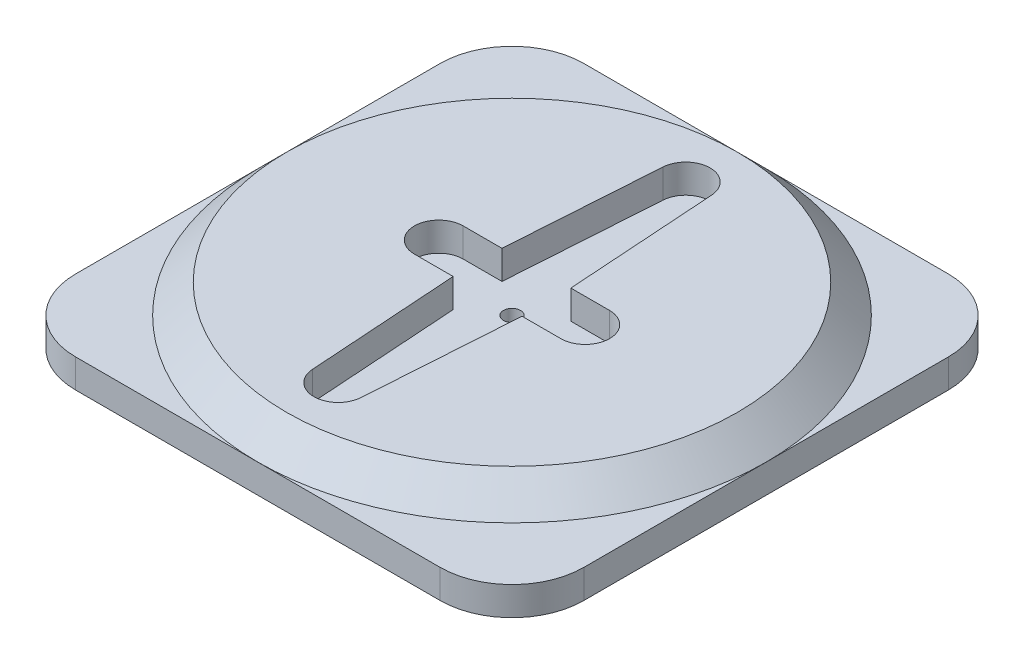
ISO-10303-21;
HEADER;
FILE_DESCRIPTION(('STEP AP214'),'2;1');
FILE_NAME('part.step','',(''),(''),'','','');
FILE_SCHEMA(('AUTOMOTIVE_DESIGN { 1 0 10303 214 1 1 1 1 }'));
ENDSEC;
DATA;
#1=APPLICATION_CONTEXT('core data for automotive mechanical design processes');
#2=APPLICATION_PROTOCOL_DEFINITION('international standard','automotive_design',2000,#1);
#3=PRODUCT_CONTEXT('',#1,'mechanical');
#4=PRODUCT('Part','Part','',(#3));
#5=PRODUCT_RELATED_PRODUCT_CATEGORY('part','',(#4));
#6=PRODUCT_DEFINITION_FORMATION('','',#4);
#7=PRODUCT_DEFINITION_CONTEXT('part definition',#1,'design');
#8=PRODUCT_DEFINITION('design','',#6,#7);
#9=PRODUCT_DEFINITION_SHAPE('','',#8);
#10=(LENGTH_UNIT() NAMED_UNIT(*) SI_UNIT(.MILLI.,.METRE.));
#11=(NAMED_UNIT(*) PLANE_ANGLE_UNIT() SI_UNIT($,.RADIAN.));
#12=(NAMED_UNIT(*) SI_UNIT($,.STERADIAN.) SOLID_ANGLE_UNIT());
#13=UNCERTAINTY_MEASURE_WITH_UNIT(LENGTH_MEASURE(1.E-05),#10,'distance_accuracy_value','');
#14=(GEOMETRIC_REPRESENTATION_CONTEXT(3) GLOBAL_UNCERTAINTY_ASSIGNED_CONTEXT((#13)) GLOBAL_UNIT_ASSIGNED_CONTEXT((#10,
#11,#12)) REPRESENTATION_CONTEXT('',''));
#15=CARTESIAN_POINT('',(0.,0.,0.));
#16=DIRECTION('',(0.,0.,1.));
#17=DIRECTION('',(1.,0.,0.));
#18=AXIS2_PLACEMENT_3D('',#15,#16,#17);
#19=CARTESIAN_POINT('',(0.,2.54,0.));
#20=DIRECTION('',(0.,-1.,0.));
#21=DIRECTION('',(0.,0.,-1.));
#22=AXIS2_PLACEMENT_3D('',#19,#20,#21);
#23=CYLINDRICAL_SURFACE('',#22,0.762);
#24=CARTESIAN_POINT('',(0.,0.,0.));
#25=DIRECTION('',(0.,1.,0.));
#26=DIRECTION('',(0.,0.,1.));
#27=AXIS2_PLACEMENT_3D('',#24,#25,#26);
#28=CIRCLE('',#27,0.762);
#29=CARTESIAN_POINT('',(0.,0.,0.762));
#30=VERTEX_POINT('',#29);
#31=EDGE_CURVE('E289',#30,#30,#28,.T.);
#32=ORIENTED_EDGE('',*,*,#31,.F.);
#33=EDGE_LOOP('',(#32));
#34=FACE_BOUND('',#33,.T.);
#35=CARTESIAN_POINT('',(0.,2.54,0.));
#36=DIRECTION('',(0.,1.,0.));
#37=DIRECTION('',(0.,0.,1.));
#38=AXIS2_PLACEMENT_3D('',#35,#36,#37);
#39=CIRCLE('',#38,0.762);
#40=CARTESIAN_POINT('',(0.,2.54,0.762));
#41=VERTEX_POINT('',#40);
#42=EDGE_CURVE('E37',#41,#41,#39,.T.);
#43=ORIENTED_EDGE('',*,*,#42,.T.);
#44=EDGE_LOOP('',(#43));
#45=FACE_BOUND('',#44,.T.);
#46=ADVANCED_FACE('F33',(#34,#45),#23,.F.);
#47=CARTESIAN_POINT('',(0.,2.54,0.));
#48=DIRECTION('',(0.,1.,0.));
#49=DIRECTION('',(0.,0.,1.));
#50=AXIS2_PLACEMENT_3D('',#47,#48,#49);
#51=PLANE('',#50);
#52=CARTESIAN_POINT('',(0.,2.54,0.));
#53=DIRECTION('',(0.,1.,0.));
#54=DIRECTION('',(0.,0.,1.));
#55=AXIS2_PLACEMENT_3D('',#52,#53,#54);
#56=CIRCLE('',#55,22.479);
#57=CARTESIAN_POINT('',(0.,2.54,22.479));
#58=VERTEX_POINT('',#57);
#59=CARTESIAN_POINT('',(22.479,2.54,0.));
#60=VERTEX_POINT('',#59);
#61=EDGE_CURVE('E286',#58,#60,#56,.T.);
#62=ORIENTED_EDGE('',*,*,#61,.F.);
#63=DIRECTION('',(1.,0.,0.));
#64=VECTOR('',#63,1.);
#65=CARTESIAN_POINT('',(-22.479,2.54,22.479));
#66=LINE('',#65,#64);
#67=CARTESIAN_POINT('',(16.129,2.54,22.479));
#68=VERTEX_POINT('',#67);
#69=EDGE_CURVE('E297',#58,#68,#66,.T.);
#70=ORIENTED_EDGE('',*,*,#69,.T.);
#71=CARTESIAN_POINT('',(16.129,2.54,16.129));
#72=DIRECTION('',(0.,1.,0.));
#73=DIRECTION('',(0.,0.,1.));
#74=AXIS2_PLACEMENT_3D('',#71,#72,#73);
#75=CIRCLE('',#74,6.35);
#76=CARTESIAN_POINT('',(22.479,2.54,16.129));
#77=VERTEX_POINT('',#76);
#78=EDGE_CURVE('E340',#68,#77,#75,.T.);
#79=ORIENTED_EDGE('',*,*,#78,.T.);
#80=DIRECTION('',(0.,0.,-1.));
#81=VECTOR('',#80,1.);
#82=CARTESIAN_POINT('',(22.479,2.54,-22.479));
#83=LINE('',#82,#81);
#84=EDGE_CURVE('E302',#77,#60,#83,.T.);
#85=ORIENTED_EDGE('',*,*,#84,.T.);
#86=EDGE_LOOP('',(#62,#70,#79,#85));
#87=FACE_BOUND('',#86,.T.);
#88=ADVANCED_FACE('F376',(#87),#51,.T.);
#89=CARTESIAN_POINT('',(0.,2.54,-22.479));
#90=VERTEX_POINT('',#89);
#91=EDGE_CURVE('E42',#60,#90,#56,.T.);
#92=ORIENTED_EDGE('',*,*,#91,.F.);
#93=CARTESIAN_POINT('',(22.479,2.54,-16.129));
#94=VERTEX_POINT('',#93);
#95=EDGE_CURVE('E301',#60,#94,#83,.T.);
#96=ORIENTED_EDGE('',*,*,#95,.T.);
#97=CARTESIAN_POINT('',(16.129,2.54,-16.129));
#98=DIRECTION('',(0.,1.,0.));
#99=DIRECTION('',(0.,0.,1.));
#100=AXIS2_PLACEMENT_3D('',#97,#98,#99);
#101=CIRCLE('',#100,6.35);
#102=CARTESIAN_POINT('',(16.129,2.54,-22.479));
#103=VERTEX_POINT('',#102);
#104=EDGE_CURVE('E346',#94,#103,#101,.T.);
#105=ORIENTED_EDGE('',*,*,#104,.T.);
#106=DIRECTION('',(-1.,0.,0.));
#107=VECTOR('',#106,1.);
#108=CARTESIAN_POINT('',(-22.479,2.54,-22.479));
#109=LINE('',#108,#107);
#110=EDGE_CURVE('E306',#103,#90,#109,.T.);
#111=ORIENTED_EDGE('',*,*,#110,.T.);
#112=EDGE_LOOP('',(#92,#96,#105,#111));
#113=FACE_BOUND('',#112,.T.);
#114=ADVANCED_FACE('F367',(#113),#51,.T.);
#115=CARTESIAN_POINT('',(-22.479,2.54,0.));
#116=VERTEX_POINT('',#115);
#117=EDGE_CURVE('E57',#90,#116,#56,.T.);
#118=ORIENTED_EDGE('',*,*,#117,.F.);
#119=CARTESIAN_POINT('',(-16.129,2.54,-22.479));
#120=VERTEX_POINT('',#119);
#121=EDGE_CURVE('E305',#90,#120,#109,.T.);
#122=ORIENTED_EDGE('',*,*,#121,.T.);
#123=CARTESIAN_POINT('',(-16.129,2.54,-16.129));
#124=DIRECTION('',(0.,1.,0.));
#125=DIRECTION('',(0.,0.,1.));
#126=AXIS2_PLACEMENT_3D('',#123,#124,#125);
#127=CIRCLE('',#126,6.35);
#128=CARTESIAN_POINT('',(-22.479,2.54,-16.129));
#129=VERTEX_POINT('',#128);
#130=EDGE_CURVE('E344',#120,#129,#127,.T.);
#131=ORIENTED_EDGE('',*,*,#130,.T.);
#132=DIRECTION('',(0.,0.,1.));
#133=VECTOR('',#132,1.);
#134=CARTESIAN_POINT('',(-22.479,2.54,-22.479));
#135=LINE('',#134,#133);
#136=EDGE_CURVE('E294',#129,#116,#135,.T.);
#137=ORIENTED_EDGE('',*,*,#136,.T.);
#138=EDGE_LOOP('',(#118,#122,#131,#137));
#139=FACE_BOUND('',#138,.T.);
#140=ADVANCED_FACE('F396',(#139),#51,.T.);
#141=EDGE_CURVE('E290',#116,#58,#56,.T.);
#142=ORIENTED_EDGE('',*,*,#141,.F.);
#143=CARTESIAN_POINT('',(-22.479,2.54,16.129));
#144=VERTEX_POINT('',#143);
#145=EDGE_CURVE('E298',#116,#144,#135,.T.);
#146=ORIENTED_EDGE('',*,*,#145,.T.);
#147=CARTESIAN_POINT('',(-16.129,2.54,16.129));
#148=DIRECTION('',(0.,1.,0.));
#149=DIRECTION('',(0.,0.,1.));
#150=AXIS2_PLACEMENT_3D('',#147,#148,#149);
#151=CIRCLE('',#150,6.35);
#152=CARTESIAN_POINT('',(-16.129,2.54,22.479));
#153=VERTEX_POINT('',#152);
#154=EDGE_CURVE('E342',#144,#153,#151,.T.);
#155=ORIENTED_EDGE('',*,*,#154,.T.);
#156=EDGE_CURVE('E299',#153,#58,#66,.T.);
#157=ORIENTED_EDGE('',*,*,#156,.T.);
#158=EDGE_LOOP('',(#142,#146,#155,#157));
#159=FACE_BOUND('',#158,.T.);
#160=ADVANCED_FACE('F410',(#159),#51,.T.);
#161=CARTESIAN_POINT('',(0.,0.,0.));
#162=DIRECTION('',(0.,1.,0.));
#163=DIRECTION('',(0.,0.,1.));
#164=AXIS2_PLACEMENT_3D('',#161,#162,#163);
#165=PLANE('',#164);
#166=DIRECTION('',(-1.,0.,0.));
#167=VECTOR('',#166,1.);
#168=CARTESIAN_POINT('',(-22.479,0.,-22.479));
#169=LINE('',#168,#167);
#170=CARTESIAN_POINT('',(16.129,0.,-22.479));
#171=VERTEX_POINT('',#170);
#172=CARTESIAN_POINT('',(-16.129,0.,-22.479));
#173=VERTEX_POINT('',#172);
#174=EDGE_CURVE('E318',#171,#173,#169,.T.);
#175=ORIENTED_EDGE('',*,*,#174,.F.);
#176=CARTESIAN_POINT('',(16.129,0.,-16.129));
#177=DIRECTION('',(0.,1.,0.));
#178=DIRECTION('',(0.,0.,1.));
#179=AXIS2_PLACEMENT_3D('',#176,#177,#178);
#180=CIRCLE('',#179,6.35);
#181=CARTESIAN_POINT('',(22.479,0.,-16.129));
#182=VERTEX_POINT('',#181);
#183=EDGE_CURVE('E332',#171,#182,#180,.F.);
#184=ORIENTED_EDGE('',*,*,#183,.T.);
#185=DIRECTION('',(0.,0.,-1.));
#186=VECTOR('',#185,1.);
#187=CARTESIAN_POINT('',(22.479,0.,-22.479));
#188=LINE('',#187,#186);
#189=CARTESIAN_POINT('',(22.479,0.,16.129));
#190=VERTEX_POINT('',#189);
#191=EDGE_CURVE('E315',#190,#182,#188,.T.);
#192=ORIENTED_EDGE('',*,*,#191,.F.);
#193=CARTESIAN_POINT('',(16.129,0.,16.129));
#194=DIRECTION('',(0.,1.,0.));
#195=DIRECTION('',(0.,0.,1.));
#196=AXIS2_PLACEMENT_3D('',#193,#194,#195);
#197=CIRCLE('',#196,6.35);
#198=CARTESIAN_POINT('',(16.129,0.,22.479));
#199=VERTEX_POINT('',#198);
#200=EDGE_CURVE('E326',#190,#199,#197,.F.);
#201=ORIENTED_EDGE('',*,*,#200,.T.);
#202=DIRECTION('',(1.,0.,0.));
#203=VECTOR('',#202,1.);
#204=CARTESIAN_POINT('',(-22.479,0.,22.479));
#205=LINE('',#204,#203);
#206=CARTESIAN_POINT('',(-16.129,0.,22.479));
#207=VERTEX_POINT('',#206);
#208=EDGE_CURVE('E312',#207,#199,#205,.T.);
#209=ORIENTED_EDGE('',*,*,#208,.F.);
#210=CARTESIAN_POINT('',(-16.129,0.,16.129));
#211=DIRECTION('',(0.,1.,0.));
#212=DIRECTION('',(0.,0.,1.));
#213=AXIS2_PLACEMENT_3D('',#210,#211,#212);
#214=CIRCLE('',#213,6.35);
#215=CARTESIAN_POINT('',(-22.479,0.,16.129));
#216=VERTEX_POINT('',#215);
#217=EDGE_CURVE('E328',#207,#216,#214,.F.);
#218=ORIENTED_EDGE('',*,*,#217,.T.);
#219=DIRECTION('',(0.,0.,1.));
#220=VECTOR('',#219,1.);
#221=CARTESIAN_POINT('',(-22.479,0.,-22.479));
#222=LINE('',#221,#220);
#223=CARTESIAN_POINT('',(-22.479,0.,-16.129));
#224=VERTEX_POINT('',#223);
#225=EDGE_CURVE('E293',#224,#216,#222,.T.);
#226=ORIENTED_EDGE('',*,*,#225,.F.);
#227=CARTESIAN_POINT('',(-16.129,0.,-16.129));
#228=DIRECTION('',(0.,1.,0.));
#229=DIRECTION('',(0.,0.,1.));
#230=AXIS2_PLACEMENT_3D('',#227,#228,#229);
#231=CIRCLE('',#230,6.35);
#232=EDGE_CURVE('E330',#224,#173,#231,.F.);
#233=ORIENTED_EDGE('',*,*,#232,.T.);
#234=EDGE_LOOP('',(#175,#184,#192,#201,#209,#218,#226,#233));
#235=FACE_BOUND('',#234,.T.);
#236=ORIENTED_EDGE('',*,*,#31,.T.);
#237=EDGE_LOOP('',(#236));
#238=FACE_BOUND('',#237,.T.);
#239=ADVANCED_FACE('F385',(#235,#238),#165,.F.);
#240=CARTESIAN_POINT('',(-22.479,2.54,-22.479));
#241=DIRECTION('',(1.,0.,0.));
#242=DIRECTION('',(0.,0.,-1.));
#243=AXIS2_PLACEMENT_3D('',#240,#241,#242);
#244=PLANE('',#243);
#245=ORIENTED_EDGE('',*,*,#136,.F.);
#246=DIRECTION('',(0.,-1.,0.));
#247=VECTOR('',#246,1.);
#248=CARTESIAN_POINT('',(-22.479,2.54,-16.129));
#249=LINE('',#248,#247);
#250=EDGE_CURVE('E351',#129,#224,#249,.T.);
#251=ORIENTED_EDGE('',*,*,#250,.T.);
#252=ORIENTED_EDGE('',*,*,#225,.T.);
#253=DIRECTION('',(0.,-1.,0.));
#254=VECTOR('',#253,1.);
#255=CARTESIAN_POINT('',(-22.479,2.54,16.129));
#256=LINE('',#255,#254);
#257=EDGE_CURVE('E348',#216,#144,#256,.F.);
#258=ORIENTED_EDGE('',*,*,#257,.T.);
#259=ORIENTED_EDGE('',*,*,#145,.F.);
#260=EDGE_LOOP('',(#245,#251,#252,#258,#259));
#261=FACE_BOUND('',#260,.T.);
#262=ADVANCED_FACE('F401',(#261),#244,.F.);
#263=CARTESIAN_POINT('',(-22.479,2.54,22.479));
#264=DIRECTION('',(0.,0.,-1.));
#265=DIRECTION('',(-1.,0.,0.));
#266=AXIS2_PLACEMENT_3D('',#263,#264,#265);
#267=PLANE('',#266);
#268=ORIENTED_EDGE('',*,*,#156,.F.);
#269=DIRECTION('',(0.,-1.,0.));
#270=VECTOR('',#269,1.);
#271=CARTESIAN_POINT('',(-16.129,2.54,22.479));
#272=LINE('',#271,#270);
#273=EDGE_CURVE('E357',#153,#207,#272,.T.);
#274=ORIENTED_EDGE('',*,*,#273,.T.);
#275=ORIENTED_EDGE('',*,*,#208,.T.);
#276=DIRECTION('',(0.,-1.,0.));
#277=VECTOR('',#276,1.);
#278=CARTESIAN_POINT('',(16.129,2.54,22.479));
#279=LINE('',#278,#277);
#280=EDGE_CURVE('E354',#199,#68,#279,.F.);
#281=ORIENTED_EDGE('',*,*,#280,.T.);
#282=ORIENTED_EDGE('',*,*,#69,.F.);
#283=EDGE_LOOP('',(#268,#274,#275,#281,#282));
#284=FACE_BOUND('',#283,.T.);
#285=ADVANCED_FACE('F411',(#284),#267,.F.);
#286=CARTESIAN_POINT('',(22.479,2.54,-22.479));
#287=DIRECTION('',(-1.,0.,0.));
#288=DIRECTION('',(0.,0.,1.));
#289=AXIS2_PLACEMENT_3D('',#286,#287,#288);
#290=PLANE('',#289);
#291=ORIENTED_EDGE('',*,*,#191,.T.);
#292=DIRECTION('',(0.,-1.,0.));
#293=VECTOR('',#292,1.);
#294=CARTESIAN_POINT('',(22.479,2.54,-16.129));
#295=LINE('',#294,#293);
#296=EDGE_CURVE('E337',#182,#94,#295,.F.);
#297=ORIENTED_EDGE('',*,*,#296,.T.);
#298=ORIENTED_EDGE('',*,*,#95,.F.);
#299=ORIENTED_EDGE('',*,*,#84,.F.);
#300=DIRECTION('',(0.,-1.,0.));
#301=VECTOR('',#300,1.);
#302=CARTESIAN_POINT('',(22.479,2.54,16.129));
#303=LINE('',#302,#301);
#304=EDGE_CURVE('E334',#77,#190,#303,.T.);
#305=ORIENTED_EDGE('',*,*,#304,.T.);
#306=EDGE_LOOP('',(#291,#297,#298,#299,#305));
#307=FACE_BOUND('',#306,.T.);
#308=ADVANCED_FACE('F371',(#307),#290,.F.);
#309=CARTESIAN_POINT('',(-22.479,2.54,-22.479));
#310=DIRECTION('',(0.,0.,1.));
#311=DIRECTION('',(1.,0.,0.));
#312=AXIS2_PLACEMENT_3D('',#309,#310,#311);
#313=PLANE('',#312);
#314=ORIENTED_EDGE('',*,*,#110,.F.);
#315=DIRECTION('',(0.,-1.,0.));
#316=VECTOR('',#315,1.);
#317=CARTESIAN_POINT('',(16.129,2.54,-22.479));
#318=LINE('',#317,#316);
#319=EDGE_CURVE('E323',#103,#171,#318,.T.);
#320=ORIENTED_EDGE('',*,*,#319,.T.);
#321=ORIENTED_EDGE('',*,*,#174,.T.);
#322=DIRECTION('',(0.,-1.,0.));
#323=VECTOR('',#322,1.);
#324=CARTESIAN_POINT('',(-16.129,2.54,-22.479));
#325=LINE('',#324,#323);
#326=EDGE_CURVE('E309',#173,#120,#325,.F.);
#327=ORIENTED_EDGE('',*,*,#326,.T.);
#328=ORIENTED_EDGE('',*,*,#121,.F.);
#329=EDGE_LOOP('',(#314,#320,#321,#327,#328));
#330=FACE_BOUND('',#329,.T.);
#331=ADVANCED_FACE('F391',(#330),#313,.F.);
#332=CARTESIAN_POINT('',(16.129,2.54,-16.129));
#333=DIRECTION('',(0.,-1.,0.));
#334=DIRECTION('',(0.,0.,-1.));
#335=AXIS2_PLACEMENT_3D('',#332,#333,#334);
#336=CYLINDRICAL_SURFACE('',#335,6.35);
#337=ORIENTED_EDGE('',*,*,#104,.F.);
#338=ORIENTED_EDGE('',*,*,#296,.F.);
#339=ORIENTED_EDGE('',*,*,#183,.F.);
#340=ORIENTED_EDGE('',*,*,#319,.F.);
#341=EDGE_LOOP('',(#337,#338,#339,#340));
#342=FACE_BOUND('',#341,.T.);
#343=ADVANCED_FACE('F389',(#342),#336,.T.);
#344=CARTESIAN_POINT('',(-16.129,2.54,-16.129));
#345=DIRECTION('',(0.,-1.,0.));
#346=DIRECTION('',(0.,0.,-1.));
#347=AXIS2_PLACEMENT_3D('',#344,#345,#346);
#348=CYLINDRICAL_SURFACE('',#347,6.35);
#349=ORIENTED_EDGE('',*,*,#130,.F.);
#350=ORIENTED_EDGE('',*,*,#326,.F.);
#351=ORIENTED_EDGE('',*,*,#232,.F.);
#352=ORIENTED_EDGE('',*,*,#250,.F.);
#353=EDGE_LOOP('',(#349,#350,#351,#352));
#354=FACE_BOUND('',#353,.T.);
#355=ADVANCED_FACE('F404',(#354),#348,.T.);
#356=CARTESIAN_POINT('',(-16.129,2.54,16.129));
#357=DIRECTION('',(0.,-1.,0.));
#358=DIRECTION('',(0.,0.,-1.));
#359=AXIS2_PLACEMENT_3D('',#356,#357,#358);
#360=CYLINDRICAL_SURFACE('',#359,6.35);
#361=ORIENTED_EDGE('',*,*,#154,.F.);
#362=ORIENTED_EDGE('',*,*,#257,.F.);
#363=ORIENTED_EDGE('',*,*,#217,.F.);
#364=ORIENTED_EDGE('',*,*,#273,.F.);
#365=EDGE_LOOP('',(#361,#362,#363,#364));
#366=FACE_BOUND('',#365,.T.);
#367=ADVANCED_FACE('F408',(#366),#360,.T.);
#368=CARTESIAN_POINT('',(16.129,2.54,16.129));
#369=DIRECTION('',(0.,-1.,0.));
#370=DIRECTION('',(0.,0.,-1.));
#371=AXIS2_PLACEMENT_3D('',#368,#369,#370);
#372=CYLINDRICAL_SURFACE('',#371,6.35);
#373=ORIENTED_EDGE('',*,*,#78,.F.);
#374=ORIENTED_EDGE('',*,*,#280,.F.);
#375=ORIENTED_EDGE('',*,*,#200,.F.);
#376=ORIENTED_EDGE('',*,*,#304,.F.);
#377=EDGE_LOOP('',(#373,#374,#375,#376));
#378=FACE_BOUND('',#377,.T.);
#379=ADVANCED_FACE('F381',(#378),#372,.T.);
#380=CARTESIAN_POINT('',(0.,5.08,0.));
#381=DIRECTION('',(0.,1.,0.));
#382=DIRECTION('',(0.,0.,1.));
#383=AXIS2_PLACEMENT_3D('',#380,#381,#382);
#384=PLANE('',#383);
#385=CARTESIAN_POINT('',(-6.477,5.08,0.));
#386=DIRECTION('',(0.,1.,0.));
#387=DIRECTION('',(0.,0.,1.));
#388=AXIS2_PLACEMENT_3D('',#385,#386,#387);
#389=CIRCLE('',#388,2.159);
#390=CARTESIAN_POINT('',(-6.477,5.08,-2.159));
#391=VERTEX_POINT('',#390);
#392=CARTESIAN_POINT('',(-6.477,5.08,2.159));
#393=VERTEX_POINT('',#392);
#394=EDGE_CURVE('E49',#391,#393,#389,.T.);
#395=ORIENTED_EDGE('',*,*,#394,.F.);
#396=DIRECTION('',(-1.,0.,0.));
#397=VECTOR('',#396,1.);
#398=CARTESIAN_POINT('',(-6.477,5.08,-2.159));
#399=LINE('',#398,#397);
#400=CARTESIAN_POINT('',(-3.04571268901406,5.08,-2.159));
#401=VERTEX_POINT('',#400);
#402=EDGE_CURVE('E205',#401,#391,#399,.T.);
#403=ORIENTED_EDGE('',*,*,#402,.F.);
#404=DIRECTION('',(-0.066622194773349,0.,0.997778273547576));
#405=VECTOR('',#404,1.);
#406=CARTESIAN_POINT('',(-2.15420329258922,5.08,-15.5108373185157));
#407=LINE('',#406,#405);
#408=CARTESIAN_POINT('',(-2.15420329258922,5.08,-15.5108373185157));
#409=VERTEX_POINT('',#408);
#410=EDGE_CURVE('E208',#409,#401,#407,.T.);
#411=ORIENTED_EDGE('',*,*,#410,.F.);
#412=CARTESIAN_POINT('',(0.,5.08,-15.367));
#413=DIRECTION('',(0.,1.,0.));
#414=DIRECTION('',(0.,0.,1.));
#415=AXIS2_PLACEMENT_3D('',#412,#413,#414);
#416=CIRCLE('',#415,2.159);
#417=CARTESIAN_POINT('',(2.15420329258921,5.08,-15.5108373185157));
#418=VERTEX_POINT('',#417);
#419=EDGE_CURVE('E260',#418,#409,#416,.T.);
#420=ORIENTED_EDGE('',*,*,#419,.F.);
#421=DIRECTION('',(-0.0666221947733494,0.,-0.997778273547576));
#422=VECTOR('',#421,1.);
#423=CARTESIAN_POINT('',(2.15420329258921,5.08,-15.5108373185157));
#424=LINE('',#423,#422);
#425=CARTESIAN_POINT('',(3.04571268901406,5.08,-2.159));
#426=VERTEX_POINT('',#425);
#427=EDGE_CURVE('E257',#426,#418,#424,.T.);
#428=ORIENTED_EDGE('',*,*,#427,.F.);
#429=DIRECTION('',(-1.,0.,0.));
#430=VECTOR('',#429,1.);
#431=CARTESIAN_POINT('',(6.47699999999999,5.08,-2.159));
#432=LINE('',#431,#430);
#433=CARTESIAN_POINT('',(6.477,5.08,-2.159));
#434=VERTEX_POINT('',#433);
#435=EDGE_CURVE('E254',#434,#426,#432,.T.);
#436=ORIENTED_EDGE('',*,*,#435,.F.);
#437=CARTESIAN_POINT('',(6.477,5.08,0.));
#438=DIRECTION('',(0.,1.,0.));
#439=DIRECTION('',(0.,0.,1.));
#440=AXIS2_PLACEMENT_3D('',#437,#438,#439);
#441=CIRCLE('',#440,2.159);
#442=CARTESIAN_POINT('',(6.47699999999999,5.08,2.159));
#443=VERTEX_POINT('',#442);
#444=EDGE_CURVE('E251',#443,#434,#441,.T.);
#445=ORIENTED_EDGE('',*,*,#444,.F.);
#446=DIRECTION('',(1.,0.,0.));
#447=VECTOR('',#446,1.);
#448=CARTESIAN_POINT('',(6.47699999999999,5.08,2.159));
#449=LINE('',#448,#447);
#450=CARTESIAN_POINT('',(3.04571268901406,5.08,2.159));
#451=VERTEX_POINT('',#450);
#452=EDGE_CURVE('E248',#451,#443,#449,.T.);
#453=ORIENTED_EDGE('',*,*,#452,.F.);
#454=DIRECTION('',(0.0666221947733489,0.,-0.997778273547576));
#455=VECTOR('',#454,1.);
#456=CARTESIAN_POINT('',(2.15420329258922,5.08,15.5108373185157));
#457=LINE('',#456,#455);
#458=CARTESIAN_POINT('',(2.15420329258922,5.08,15.5108373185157));
#459=VERTEX_POINT('',#458);
#460=EDGE_CURVE('E245',#459,#451,#457,.T.);
#461=ORIENTED_EDGE('',*,*,#460,.F.);
#462=CARTESIAN_POINT('',(0.,5.08,15.367));
#463=DIRECTION('',(0.,1.,0.));
#464=DIRECTION('',(0.,0.,1.));
#465=AXIS2_PLACEMENT_3D('',#462,#463,#464);
#466=CIRCLE('',#465,2.159);
#467=CARTESIAN_POINT('',(-2.15420329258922,5.08,15.5108373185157));
#468=VERTEX_POINT('',#467);
#469=EDGE_CURVE('E242',#468,#459,#466,.T.);
#470=ORIENTED_EDGE('',*,*,#469,.F.);
#471=DIRECTION('',(0.0666221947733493,0.,0.997778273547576));
#472=VECTOR('',#471,1.);
#473=CARTESIAN_POINT('',(-2.15420329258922,5.08,15.5108373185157));
#474=LINE('',#473,#472);
#475=CARTESIAN_POINT('',(-3.04571268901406,5.08,2.159));
#476=VERTEX_POINT('',#475);
#477=EDGE_CURVE('E239',#476,#468,#474,.T.);
#478=ORIENTED_EDGE('',*,*,#477,.F.);
#479=DIRECTION('',(1.,0.,0.));
#480=VECTOR('',#479,1.);
#481=CARTESIAN_POINT('',(-6.477,5.08,2.159));
#482=LINE('',#481,#480);
#483=EDGE_CURVE('E237',#393,#476,#482,.T.);
#484=ORIENTED_EDGE('',*,*,#483,.F.);
#485=EDGE_LOOP('',(#395,#403,#411,#420,#428,#436,#445,#453,#461,#470,#478,#484));
#486=FACE_BOUND('',#485,.T.);
#487=CARTESIAN_POINT('',(0.,5.08,0.));
#488=DIRECTION('',(0.,1.,0.));
#489=DIRECTION('',(0.,0.,1.));
#490=AXIS2_PLACEMENT_3D('',#487,#488,#489);
#491=CIRCLE('',#490,19.939);
#492=CARTESIAN_POINT('',(0.,5.08,19.939));
#493=VERTEX_POINT('',#492);
#494=EDGE_CURVE('E11',#493,#493,#491,.T.);
#495=ORIENTED_EDGE('',*,*,#494,.T.);
#496=EDGE_LOOP('',(#495));
#497=FACE_BOUND('',#496,.T.);
#498=ADVANCED_FACE('F430',(#486,#497),#384,.T.);
#499=CARTESIAN_POINT('',(0.,5.08,0.));
#500=DIRECTION('',(0.,-1.,0.));
#501=DIRECTION('',(0.,0.,-1.));
#502=AXIS2_PLACEMENT_3D('',#499,#500,#501);
#503=CONICAL_SURFACE('',#502,19.939,0.785398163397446);
#504=ORIENTED_EDGE('',*,*,#117,.T.);
#505=ORIENTED_EDGE('',*,*,#141,.T.);
#506=ORIENTED_EDGE('',*,*,#61,.T.);
#507=ORIENTED_EDGE('',*,*,#91,.T.);
#508=EDGE_LOOP('',(#504,#505,#506,#507));
#509=FACE_BOUND('',#508,.T.);
#510=ORIENTED_EDGE('',*,*,#494,.F.);
#511=EDGE_LOOP('',(#510));
#512=FACE_BOUND('',#511,.T.);
#513=ADVANCED_FACE('F35',(#509,#512),#503,.T.);
#514=CARTESIAN_POINT('',(-6.477,2.54,0.));
#515=DIRECTION('',(0.,1.,0.));
#516=DIRECTION('',(0.,0.,1.));
#517=AXIS2_PLACEMENT_3D('',#514,#515,#516);
#518=CYLINDRICAL_SURFACE('',#517,2.159);
#519=ORIENTED_EDGE('',*,*,#394,.T.);
#520=DIRECTION('',(0.,1.,0.));
#521=VECTOR('',#520,1.);
#522=CARTESIAN_POINT('',(-6.477,2.54,2.159));
#523=LINE('',#522,#521);
#524=CARTESIAN_POINT('',(-6.477,2.54,2.159));
#525=VERTEX_POINT('',#524);
#526=EDGE_CURVE('E182',#525,#393,#523,.T.);
#527=ORIENTED_EDGE('',*,*,#526,.F.);
#528=CARTESIAN_POINT('',(-6.477,2.54,0.));
#529=DIRECTION('',(0.,1.,0.));
#530=DIRECTION('',(0.,0.,1.));
#531=AXIS2_PLACEMENT_3D('',#528,#529,#530);
#532=CIRCLE('',#531,2.159);
#533=CARTESIAN_POINT('',(-6.477,2.54,-2.159));
#534=VERTEX_POINT('',#533);
#535=EDGE_CURVE('E186',#534,#525,#532,.T.);
#536=ORIENTED_EDGE('',*,*,#535,.F.);
#537=DIRECTION('',(0.,1.,0.));
#538=VECTOR('',#537,1.);
#539=CARTESIAN_POINT('',(-6.477,2.54,-2.159));
#540=LINE('',#539,#538);
#541=EDGE_CURVE('E265',#534,#391,#540,.T.);
#542=ORIENTED_EDGE('',*,*,#541,.T.);
#543=EDGE_LOOP('',(#519,#527,#536,#542));
#544=FACE_BOUND('',#543,.T.);
#545=ADVANCED_FACE('F184',(#544),#518,.F.);
#546=CARTESIAN_POINT('',(-6.477,2.54,-2.159));
#547=DIRECTION('',(0.,0.,-1.));
#548=DIRECTION('',(-1.,0.,0.));
#549=AXIS2_PLACEMENT_3D('',#546,#547,#548);
#550=PLANE('',#549);
#551=ORIENTED_EDGE('',*,*,#402,.T.);
#552=ORIENTED_EDGE('',*,*,#541,.F.);
#553=DIRECTION('',(-1.,0.,0.));
#554=VECTOR('',#553,1.);
#555=CARTESIAN_POINT('',(-6.477,2.54,-2.159));
#556=LINE('',#555,#554);
#557=CARTESIAN_POINT('',(-3.04571268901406,2.54,-2.159));
#558=VERTEX_POINT('',#557);
#559=EDGE_CURVE('E192',#558,#534,#556,.T.);
#560=ORIENTED_EDGE('',*,*,#559,.F.);
#561=DIRECTION('',(0.,1.,0.));
#562=VECTOR('',#561,1.);
#563=CARTESIAN_POINT('',(-3.04571268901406,2.54,-2.159));
#564=LINE('',#563,#562);
#565=EDGE_CURVE('E267',#558,#401,#564,.T.);
#566=ORIENTED_EDGE('',*,*,#565,.T.);
#567=EDGE_LOOP('',(#551,#552,#560,#566));
#568=FACE_BOUND('',#567,.T.);
#569=ADVANCED_FACE('F494',(#568),#550,.F.);
#570=CARTESIAN_POINT('',(-2.15420329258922,2.54,-15.5108373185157));
#571=DIRECTION('',(-0.997778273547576,0.,-0.066622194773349));
#572=DIRECTION('',(-0.066622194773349,0.,0.997778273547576));
#573=AXIS2_PLACEMENT_3D('',#570,#571,#572);
#574=PLANE('',#573);
#575=ORIENTED_EDGE('',*,*,#410,.T.);
#576=ORIENTED_EDGE('',*,*,#565,.F.);
#577=DIRECTION('',(-0.066622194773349,0.,0.997778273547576));
#578=VECTOR('',#577,1.);
#579=CARTESIAN_POINT('',(-2.15420329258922,2.54,-15.5108373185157));
#580=LINE('',#579,#578);
#581=CARTESIAN_POINT('',(-2.15420329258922,2.54,-15.5108373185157));
#582=VERTEX_POINT('',#581);
#583=EDGE_CURVE('E233',#582,#558,#580,.T.);
#584=ORIENTED_EDGE('',*,*,#583,.F.);
#585=DIRECTION('',(0.,1.,0.));
#586=VECTOR('',#585,1.);
#587=CARTESIAN_POINT('',(-2.15420329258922,2.54,-15.5108373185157));
#588=LINE('',#587,#586);
#589=EDGE_CURVE('E269',#582,#409,#588,.T.);
#590=ORIENTED_EDGE('',*,*,#589,.T.);
#591=EDGE_LOOP('',(#575,#576,#584,#590));
#592=FACE_BOUND('',#591,.T.);
#593=ADVANCED_FACE('F492',(#592),#574,.F.);
#594=CARTESIAN_POINT('',(0.,2.54,-15.367));
#595=DIRECTION('',(0.,1.,0.));
#596=DIRECTION('',(0.,0.,1.));
#597=AXIS2_PLACEMENT_3D('',#594,#595,#596);
#598=CYLINDRICAL_SURFACE('',#597,2.159);
#599=ORIENTED_EDGE('',*,*,#419,.T.);
#600=ORIENTED_EDGE('',*,*,#589,.F.);
#601=CARTESIAN_POINT('',(0.,2.54,-15.367));
#602=DIRECTION('',(0.,1.,0.));
#603=DIRECTION('',(0.,0.,1.));
#604=AXIS2_PLACEMENT_3D('',#601,#602,#603);
#605=CIRCLE('',#604,2.159);
#606=CARTESIAN_POINT('',(2.15420329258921,2.54,-15.5108373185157));
#607=VERTEX_POINT('',#606);
#608=EDGE_CURVE('E230',#607,#582,#605,.T.);
#609=ORIENTED_EDGE('',*,*,#608,.F.);
#610=DIRECTION('',(0.,1.,0.));
#611=VECTOR('',#610,1.);
#612=CARTESIAN_POINT('',(2.15420329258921,2.54,-15.5108373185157));
#613=LINE('',#612,#611);
#614=EDGE_CURVE('E271',#607,#418,#613,.T.);
#615=ORIENTED_EDGE('',*,*,#614,.T.);
#616=EDGE_LOOP('',(#599,#600,#609,#615));
#617=FACE_BOUND('',#616,.T.);
#618=ADVANCED_FACE('F489',(#617),#598,.F.);
#619=CARTESIAN_POINT('',(2.15420329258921,2.54,-15.5108373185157));
#620=DIRECTION('',(0.997778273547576,0.,-0.0666221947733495));
#621=DIRECTION('',(-0.0666221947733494,0.,-0.997778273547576));
#622=AXIS2_PLACEMENT_3D('',#619,#620,#621);
#623=PLANE('',#622);
#624=ORIENTED_EDGE('',*,*,#427,.T.);
#625=ORIENTED_EDGE('',*,*,#614,.F.);
#626=DIRECTION('',(-0.0666221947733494,0.,-0.997778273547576));
#627=VECTOR('',#626,1.);
#628=CARTESIAN_POINT('',(2.15420329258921,2.54,-15.5108373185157));
#629=LINE('',#628,#627);
#630=CARTESIAN_POINT('',(3.04571268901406,2.54,-2.159));
#631=VERTEX_POINT('',#630);
#632=EDGE_CURVE('E227',#631,#607,#629,.T.);
#633=ORIENTED_EDGE('',*,*,#632,.F.);
#634=DIRECTION('',(0.,1.,0.));
#635=VECTOR('',#634,1.);
#636=CARTESIAN_POINT('',(3.04571268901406,2.54,-2.159));
#637=LINE('',#636,#635);
#638=EDGE_CURVE('E273',#631,#426,#637,.T.);
#639=ORIENTED_EDGE('',*,*,#638,.T.);
#640=EDGE_LOOP('',(#624,#625,#633,#639));
#641=FACE_BOUND('',#640,.T.);
#642=ADVANCED_FACE('F485',(#641),#623,.F.);
#643=CARTESIAN_POINT('',(6.47699999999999,2.54,-2.159));
#644=DIRECTION('',(0.,0.,-1.));
#645=DIRECTION('',(-1.,0.,0.));
#646=AXIS2_PLACEMENT_3D('',#643,#644,#645);
#647=PLANE('',#646);
#648=ORIENTED_EDGE('',*,*,#435,.T.);
#649=ORIENTED_EDGE('',*,*,#638,.F.);
#650=DIRECTION('',(-1.,0.,0.));
#651=VECTOR('',#650,1.);
#652=CARTESIAN_POINT('',(6.47699999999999,2.54,-2.159));
#653=LINE('',#652,#651);
#654=CARTESIAN_POINT('',(6.477,2.54,-2.159));
#655=VERTEX_POINT('',#654);
#656=EDGE_CURVE('E224',#655,#631,#653,.T.);
#657=ORIENTED_EDGE('',*,*,#656,.F.);
#658=DIRECTION('',(0.,1.,0.));
#659=VECTOR('',#658,1.);
#660=CARTESIAN_POINT('',(6.477,2.54,-2.159));
#661=LINE('',#660,#659);
#662=EDGE_CURVE('E275',#655,#434,#661,.T.);
#663=ORIENTED_EDGE('',*,*,#662,.T.);
#664=EDGE_LOOP('',(#648,#649,#657,#663));
#665=FACE_BOUND('',#664,.T.);
#666=ADVANCED_FACE('F481',(#665),#647,.F.);
#667=CARTESIAN_POINT('',(6.477,2.54,0.));
#668=DIRECTION('',(0.,1.,0.));
#669=DIRECTION('',(0.,0.,1.));
#670=AXIS2_PLACEMENT_3D('',#667,#668,#669);
#671=CYLINDRICAL_SURFACE('',#670,2.159);
#672=ORIENTED_EDGE('',*,*,#444,.T.);
#673=ORIENTED_EDGE('',*,*,#662,.F.);
#674=CARTESIAN_POINT('',(6.477,2.54,0.));
#675=DIRECTION('',(0.,1.,0.));
#676=DIRECTION('',(0.,0.,1.));
#677=AXIS2_PLACEMENT_3D('',#674,#675,#676);
#678=CIRCLE('',#677,2.159);
#679=CARTESIAN_POINT('',(6.47699999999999,2.54,2.159));
#680=VERTEX_POINT('',#679);
#681=EDGE_CURVE('E221',#680,#655,#678,.T.);
#682=ORIENTED_EDGE('',*,*,#681,.F.);
#683=DIRECTION('',(0.,1.,0.));
#684=VECTOR('',#683,1.);
#685=CARTESIAN_POINT('',(6.47699999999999,2.54,2.159));
#686=LINE('',#685,#684);
#687=EDGE_CURVE('E277',#680,#443,#686,.T.);
#688=ORIENTED_EDGE('',*,*,#687,.T.);
#689=EDGE_LOOP('',(#672,#673,#682,#688));
#690=FACE_BOUND('',#689,.T.);
#691=ADVANCED_FACE('F477',(#690),#671,.F.);
#692=CARTESIAN_POINT('',(6.47699999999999,2.54,2.159));
#693=DIRECTION('',(0.,0.,1.));
#694=DIRECTION('',(1.,0.,0.));
#695=AXIS2_PLACEMENT_3D('',#692,#693,#694);
#696=PLANE('',#695);
#697=ORIENTED_EDGE('',*,*,#452,.T.);
#698=ORIENTED_EDGE('',*,*,#687,.F.);
#699=DIRECTION('',(1.,0.,0.));
#700=VECTOR('',#699,1.);
#701=CARTESIAN_POINT('',(6.47699999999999,2.54,2.159));
#702=LINE('',#701,#700);
#703=CARTESIAN_POINT('',(3.04571268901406,2.54,2.159));
#704=VERTEX_POINT('',#703);
#705=EDGE_CURVE('E218',#704,#680,#702,.T.);
#706=ORIENTED_EDGE('',*,*,#705,.F.);
#707=DIRECTION('',(0.,1.,0.));
#708=VECTOR('',#707,1.);
#709=CARTESIAN_POINT('',(3.04571268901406,2.54,2.159));
#710=LINE('',#709,#708);
#711=EDGE_CURVE('E279',#704,#451,#710,.T.);
#712=ORIENTED_EDGE('',*,*,#711,.T.);
#713=EDGE_LOOP('',(#697,#698,#706,#712));
#714=FACE_BOUND('',#713,.T.);
#715=ADVANCED_FACE('F473',(#714),#696,.F.);
#716=CARTESIAN_POINT('',(2.15420329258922,2.54,15.5108373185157));
#717=DIRECTION('',(0.997778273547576,0.,0.0666221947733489));
#718=DIRECTION('',(0.0666221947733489,0.,-0.997778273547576));
#719=AXIS2_PLACEMENT_3D('',#716,#717,#718);
#720=PLANE('',#719);
#721=ORIENTED_EDGE('',*,*,#460,.T.);
#722=ORIENTED_EDGE('',*,*,#711,.F.);
#723=DIRECTION('',(0.0666221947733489,0.,-0.997778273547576));
#724=VECTOR('',#723,1.);
#725=CARTESIAN_POINT('',(2.15420329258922,2.54,15.5108373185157));
#726=LINE('',#725,#724);
#727=CARTESIAN_POINT('',(2.15420329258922,2.54,15.5108373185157));
#728=VERTEX_POINT('',#727);
#729=EDGE_CURVE('E215',#728,#704,#726,.T.);
#730=ORIENTED_EDGE('',*,*,#729,.F.);
#731=DIRECTION('',(0.,1.,0.));
#732=VECTOR('',#731,1.);
#733=CARTESIAN_POINT('',(2.15420329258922,2.54,15.5108373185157));
#734=LINE('',#733,#732);
#735=EDGE_CURVE('E281',#728,#459,#734,.T.);
#736=ORIENTED_EDGE('',*,*,#735,.T.);
#737=EDGE_LOOP('',(#721,#722,#730,#736));
#738=FACE_BOUND('',#737,.T.);
#739=ADVANCED_FACE('F469',(#738),#720,.F.);
#740=CARTESIAN_POINT('',(0.,2.54,15.367));
#741=DIRECTION('',(0.,1.,0.));
#742=DIRECTION('',(0.,0.,1.));
#743=AXIS2_PLACEMENT_3D('',#740,#741,#742);
#744=CYLINDRICAL_SURFACE('',#743,2.159);
#745=ORIENTED_EDGE('',*,*,#469,.T.);
#746=ORIENTED_EDGE('',*,*,#735,.F.);
#747=CARTESIAN_POINT('',(0.,2.54,15.367));
#748=DIRECTION('',(0.,1.,0.));
#749=DIRECTION('',(0.,0.,1.));
#750=AXIS2_PLACEMENT_3D('',#747,#748,#749);
#751=CIRCLE('',#750,2.159);
#752=CARTESIAN_POINT('',(-2.15420329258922,2.54,15.5108373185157));
#753=VERTEX_POINT('',#752);
#754=EDGE_CURVE('E212',#753,#728,#751,.T.);
#755=ORIENTED_EDGE('',*,*,#754,.F.);
#756=DIRECTION('',(0.,1.,0.));
#757=VECTOR('',#756,1.);
#758=CARTESIAN_POINT('',(-2.15420329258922,2.54,15.5108373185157));
#759=LINE('',#758,#757);
#760=EDGE_CURVE('E283',#753,#468,#759,.T.);
#761=ORIENTED_EDGE('',*,*,#760,.T.);
#762=EDGE_LOOP('',(#745,#746,#755,#761));
#763=FACE_BOUND('',#762,.T.);
#764=ADVANCED_FACE('F467',(#763),#744,.F.);
#765=CARTESIAN_POINT('',(-2.15420329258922,2.54,15.5108373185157));
#766=DIRECTION('',(-0.997778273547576,0.,0.0666221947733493));
#767=DIRECTION('',(0.0666221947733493,0.,0.997778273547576));
#768=AXIS2_PLACEMENT_3D('',#765,#766,#767);
#769=PLANE('',#768);
#770=ORIENTED_EDGE('',*,*,#477,.T.);
#771=ORIENTED_EDGE('',*,*,#760,.F.);
#772=DIRECTION('',(0.0666221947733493,0.,0.997778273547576));
#773=VECTOR('',#772,1.);
#774=CARTESIAN_POINT('',(-2.15420329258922,2.54,15.5108373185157));
#775=LINE('',#774,#773);
#776=CARTESIAN_POINT('',(-3.04571268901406,2.54,2.159));
#777=VERTEX_POINT('',#776);
#778=EDGE_CURVE('E200',#777,#753,#775,.T.);
#779=ORIENTED_EDGE('',*,*,#778,.F.);
#780=DIRECTION('',(0.,1.,0.));
#781=VECTOR('',#780,1.);
#782=CARTESIAN_POINT('',(-3.04571268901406,2.54,2.159));
#783=LINE('',#782,#781);
#784=EDGE_CURVE('E191',#777,#476,#783,.T.);
#785=ORIENTED_EDGE('',*,*,#784,.T.);
#786=EDGE_LOOP('',(#770,#771,#779,#785));
#787=FACE_BOUND('',#786,.T.);
#788=ADVANCED_FACE('F463',(#787),#769,.F.);
#789=CARTESIAN_POINT('',(-6.477,2.54,2.159));
#790=DIRECTION('',(0.,0.,1.));
#791=DIRECTION('',(1.,0.,0.));
#792=AXIS2_PLACEMENT_3D('',#789,#790,#791);
#793=PLANE('',#792);
#794=ORIENTED_EDGE('',*,*,#483,.T.);
#795=ORIENTED_EDGE('',*,*,#784,.F.);
#796=DIRECTION('',(1.,0.,0.));
#797=VECTOR('',#796,1.);
#798=CARTESIAN_POINT('',(-6.477,2.54,2.159));
#799=LINE('',#798,#797);
#800=EDGE_CURVE('E195',#525,#777,#799,.T.);
#801=ORIENTED_EDGE('',*,*,#800,.F.);
#802=ORIENTED_EDGE('',*,*,#526,.T.);
#803=EDGE_LOOP('',(#794,#795,#801,#802));
#804=FACE_BOUND('',#803,.T.);
#805=ADVANCED_FACE('F196',(#804),#793,.F.);
#806=CARTESIAN_POINT('',(-6.477,2.54,0.));
#807=DIRECTION('',(0.,1.,0.));
#808=DIRECTION('',(0.,0.,1.));
#809=AXIS2_PLACEMENT_3D('',#806,#807,#808);
#810=PLANE('',#809);
#811=ORIENTED_EDGE('',*,*,#42,.F.);
#812=EDGE_LOOP('',(#811));
#813=FACE_BOUND('',#812,.T.);
#814=ORIENTED_EDGE('',*,*,#535,.T.);
#815=ORIENTED_EDGE('',*,*,#800,.T.);
#816=ORIENTED_EDGE('',*,*,#778,.T.);
#817=ORIENTED_EDGE('',*,*,#754,.T.);
#818=ORIENTED_EDGE('',*,*,#729,.T.);
#819=ORIENTED_EDGE('',*,*,#705,.T.);
#820=ORIENTED_EDGE('',*,*,#681,.T.);
#821=ORIENTED_EDGE('',*,*,#656,.T.);
#822=ORIENTED_EDGE('',*,*,#632,.T.);
#823=ORIENTED_EDGE('',*,*,#608,.T.);
#824=ORIENTED_EDGE('',*,*,#583,.T.);
#825=ORIENTED_EDGE('',*,*,#559,.T.);
#826=EDGE_LOOP('',(#814,#815,#816,#817,#818,#819,#820,#821,#822,#823,#824,#825));
#827=FACE_BOUND('',#826,.T.);
#828=ADVANCED_FACE('F202',(#813,#827),#810,.T.);
#829=CLOSED_SHELL('',(#46,#88,#114,#140,#160,#239,#262,#285,#308,#331,#343,#355,#367,#379,#498,
#513,#545,#569,#593,#618,#642,#666,#691,#715,#739,#764,#788,#805,#828));
#830=MANIFOLD_SOLID_BREP('B2',#829);
#831=ADVANCED_BREP_SHAPE_REPRESENTATION('',(#18,#830),#14);
#832=SHAPE_DEFINITION_REPRESENTATION(#9,#831);
ENDSEC;
END-ISO-10303-21;
